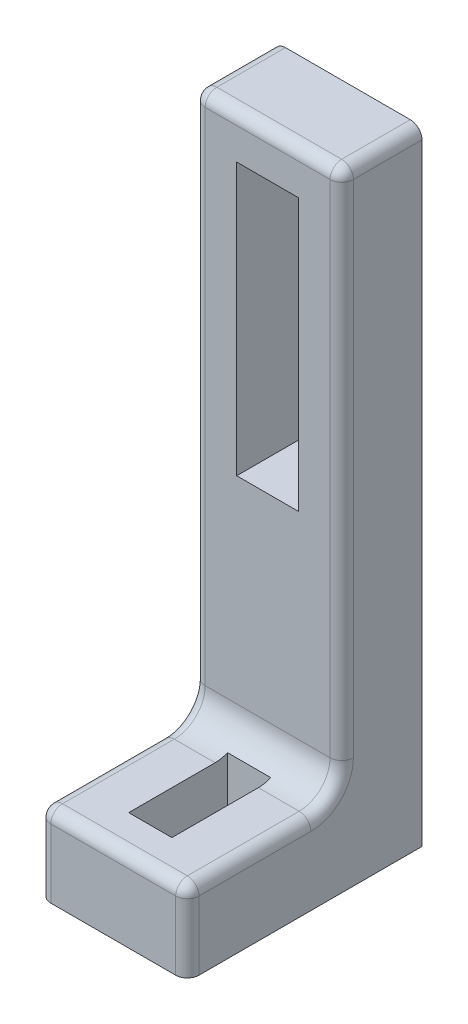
ISO-10303-21;
HEADER;
FILE_DESCRIPTION(('STEP AP214'),'2;1');
FILE_NAME('part.step','',(''),(''),'','','');
FILE_SCHEMA(('AUTOMOTIVE_DESIGN { 1 0 10303 214 1 1 1 1 }'));
ENDSEC;
DATA;
#1=APPLICATION_CONTEXT('core data for automotive mechanical design processes');
#2=APPLICATION_PROTOCOL_DEFINITION('international standard','automotive_design',2000,#1);
#3=PRODUCT_CONTEXT('',#1,'mechanical');
#4=PRODUCT('Part','Part','',(#3));
#5=PRODUCT_RELATED_PRODUCT_CATEGORY('part','',(#4));
#6=PRODUCT_DEFINITION_FORMATION('','',#4);
#7=PRODUCT_DEFINITION_CONTEXT('part definition',#1,'design');
#8=PRODUCT_DEFINITION('design','',#6,#7);
#9=PRODUCT_DEFINITION_SHAPE('','',#8);
#10=(LENGTH_UNIT() NAMED_UNIT(*) SI_UNIT(.MILLI.,.METRE.));
#11=(NAMED_UNIT(*) PLANE_ANGLE_UNIT() SI_UNIT($,.RADIAN.));
#12=(NAMED_UNIT(*) SI_UNIT($,.STERADIAN.) SOLID_ANGLE_UNIT());
#13=UNCERTAINTY_MEASURE_WITH_UNIT(LENGTH_MEASURE(1.E-05),#10,'distance_accuracy_value','');
#14=(GEOMETRIC_REPRESENTATION_CONTEXT(3) GLOBAL_UNCERTAINTY_ASSIGNED_CONTEXT((#13)) GLOBAL_UNIT_ASSIGNED_CONTEXT((#10,
#11,#12)) REPRESENTATION_CONTEXT('',''));
#15=CARTESIAN_POINT('',(0.,0.,0.));
#16=DIRECTION('',(0.,0.,1.));
#17=DIRECTION('',(1.,0.,0.));
#18=AXIS2_PLACEMENT_3D('',#15,#16,#17);
#19=CARTESIAN_POINT('',(19.05,125.3375,43.1375));
#20=DIRECTION('',(0.,-1.,0.));
#21=DIRECTION('',(0.,0.,-1.));
#22=AXIS2_PLACEMENT_3D('',#19,#20,#21);
#23=PLANE('',#22);
#24=DIRECTION('',(0.,0.,1.));
#25=VECTOR('',#24,1.);
#26=CARTESIAN_POINT('',(-16.05,125.3375,43.1375));
#27=LINE('',#26,#25);
#28=CARTESIAN_POINT('',(-16.05,125.3375,22.5));
#29=VERTEX_POINT('',#28);
#30=CARTESIAN_POINT('',(-16.05,125.3375,40.1375));
#31=VERTEX_POINT('',#30);
#32=EDGE_CURVE('E309',#29,#31,#27,.T.);
#33=ORIENTED_EDGE('',*,*,#32,.T.);
#34=DIRECTION('',(-1.,0.,0.));
#35=VECTOR('',#34,1.);
#36=CARTESIAN_POINT('',(19.05,125.3375,40.1375));
#37=LINE('',#36,#35);
#38=CARTESIAN_POINT('',(16.05,125.3375,40.1375));
#39=VERTEX_POINT('',#38);
#40=EDGE_CURVE('E11',#31,#39,#37,.F.);
#41=ORIENTED_EDGE('',*,*,#40,.T.);
#42=DIRECTION('',(0.,0.,1.));
#43=VECTOR('',#42,1.);
#44=CARTESIAN_POINT('',(16.05,125.3375,43.1375));
#45=LINE('',#44,#43);
#46=CARTESIAN_POINT('',(16.05,125.3375,22.5));
#47=VERTEX_POINT('',#46);
#48=EDGE_CURVE('E307',#39,#47,#45,.F.);
#49=ORIENTED_EDGE('',*,*,#48,.T.);
#50=DIRECTION('',(-1.,0.,0.));
#51=VECTOR('',#50,1.);
#52=CARTESIAN_POINT('',(19.05,125.3375,22.5));
#53=LINE('',#52,#51);
#54=EDGE_CURVE('E279',#47,#29,#53,.T.);
#55=ORIENTED_EDGE('',*,*,#54,.T.);
#56=EDGE_LOOP('',(#33,#41,#49,#55));
#57=FACE_BOUND('',#56,.T.);
#58=ADVANCED_FACE('F36',(#57),#23,.F.);
#59=CARTESIAN_POINT('',(19.05,-14.3625,43.1375));
#60=DIRECTION('',(0.,0.,-1.));
#61=DIRECTION('',(0.,1.,0.));
#62=AXIS2_PLACEMENT_3D('',#59,#60,#61);
#63=PLANE('',#62);
#64=DIRECTION('',(-1.,0.,0.));
#65=VECTOR('',#64,1.);
#66=CARTESIAN_POINT('',(19.05,-6.42500000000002,43.1375));
#67=LINE('',#66,#65);
#68=CARTESIAN_POINT('',(-16.05,-6.42500000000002,43.1375));
#69=VERTEX_POINT('',#68);
#70=CARTESIAN_POINT('',(16.05,-6.42500000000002,43.1375));
#71=VERTEX_POINT('',#70);
#72=EDGE_CURVE('E296',#69,#71,#67,.F.);
#73=ORIENTED_EDGE('',*,*,#72,.T.);
#74=DIRECTION('',(0.,-1.,0.));
#75=VECTOR('',#74,1.);
#76=CARTESIAN_POINT('',(16.05,-14.3625,43.1375));
#77=LINE('',#76,#75);
#78=CARTESIAN_POINT('',(16.05,122.3375,43.1375));
#79=VERTEX_POINT('',#78);
#80=EDGE_CURVE('E346',#71,#79,#77,.F.);
#81=ORIENTED_EDGE('',*,*,#80,.T.);
#82=DIRECTION('',(-1.,0.,0.));
#83=VECTOR('',#82,1.);
#84=CARTESIAN_POINT('',(19.05,122.3375,43.1375));
#85=LINE('',#84,#83);
#86=CARTESIAN_POINT('',(-16.05,122.3375,43.1375));
#87=VERTEX_POINT('',#86);
#88=EDGE_CURVE('E342',#79,#87,#85,.T.);
#89=ORIENTED_EDGE('',*,*,#88,.T.);
#90=DIRECTION('',(0.,-1.,0.));
#91=VECTOR('',#90,1.);
#92=CARTESIAN_POINT('',(-16.05,-6.42500000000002,43.1375));
#93=LINE('',#92,#91);
#94=EDGE_CURVE('E344',#87,#69,#93,.T.);
#95=ORIENTED_EDGE('',*,*,#94,.T.);
#96=EDGE_LOOP('',(#73,#81,#89,#95));
#97=FACE_BOUND('',#96,.T.);
#98=DIRECTION('',(1.,0.,0.));
#99=VECTOR('',#98,1.);
#100=CARTESIAN_POINT('',(-7.93749999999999,44.375,43.1375));
#101=LINE('',#100,#99);
#102=CARTESIAN_POINT('',(-7.93749999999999,44.375,43.1375));
#103=VERTEX_POINT('',#102);
#104=CARTESIAN_POINT('',(7.93749999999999,44.375,43.1375));
#105=VERTEX_POINT('',#104);
#106=EDGE_CURVE('E256',#103,#105,#101,.T.);
#107=ORIENTED_EDGE('',*,*,#106,.F.);
#108=DIRECTION('',(0.,-1.,0.));
#109=VECTOR('',#108,1.);
#110=CARTESIAN_POINT('',(-7.9375,114.225,43.1375));
#111=LINE('',#110,#109);
#112=CARTESIAN_POINT('',(-7.9375,114.225,43.1375));
#113=VERTEX_POINT('',#112);
#114=EDGE_CURVE('E237',#113,#103,#111,.T.);
#115=ORIENTED_EDGE('',*,*,#114,.F.);
#116=DIRECTION('',(-1.,0.,0.));
#117=VECTOR('',#116,1.);
#118=CARTESIAN_POINT('',(-7.9375,114.225,43.1375));
#119=LINE('',#118,#117);
#120=CARTESIAN_POINT('',(7.9375,114.225,43.1375));
#121=VERTEX_POINT('',#120);
#122=EDGE_CURVE('E245',#121,#113,#119,.T.);
#123=ORIENTED_EDGE('',*,*,#122,.F.);
#124=DIRECTION('',(0.,1.,0.));
#125=VECTOR('',#124,1.);
#126=CARTESIAN_POINT('',(7.9375,114.225,43.1375));
#127=LINE('',#126,#125);
#128=EDGE_CURVE('E259',#105,#121,#127,.T.);
#129=ORIENTED_EDGE('',*,*,#128,.F.);
#130=EDGE_LOOP('',(#107,#115,#123,#129));
#131=FACE_BOUND('',#130,.T.);
#132=ADVANCED_FACE('F448',(#97,#131),#63,.F.);
#133=CARTESIAN_POINT('',(19.05,-14.3625,82.825));
#134=DIRECTION('',(0.,-1.,0.));
#135=DIRECTION('',(0.,0.,-1.));
#136=AXIS2_PLACEMENT_3D('',#133,#134,#135);
#137=PLANE('',#136);
#138=DIRECTION('',(-1.,0.,0.));
#139=VECTOR('',#138,1.);
#140=CARTESIAN_POINT('',(19.05,-14.3625,79.825));
#141=LINE('',#140,#139);
#142=CARTESIAN_POINT('',(-16.05,-14.3625,79.825));
#143=VERTEX_POINT('',#142);
#144=CARTESIAN_POINT('',(16.05,-14.3625,79.825));
#145=VERTEX_POINT('',#144);
#146=EDGE_CURVE('E355',#143,#145,#141,.F.);
#147=ORIENTED_EDGE('',*,*,#146,.T.);
#148=DIRECTION('',(0.,0.,1.));
#149=VECTOR('',#148,1.);
#150=CARTESIAN_POINT('',(16.05,-14.3625,82.825));
#151=LINE('',#150,#149);
#152=CARTESIAN_POINT('',(16.05,-14.3625,51.075));
#153=VERTEX_POINT('',#152);
#154=EDGE_CURVE('E357',#145,#153,#151,.F.);
#155=ORIENTED_EDGE('',*,*,#154,.T.);
#156=DIRECTION('',(-1.,0.,0.));
#157=VECTOR('',#156,1.);
#158=CARTESIAN_POINT('',(-19.05,-14.3625,51.075));
#159=LINE('',#158,#157);
#160=CARTESIAN_POINT('',(5.55625,-14.3625,51.075));
#161=VERTEX_POINT('',#160);
#162=EDGE_CURVE('E294',#153,#161,#159,.T.);
#163=ORIENTED_EDGE('',*,*,#162,.T.);
#164=DIRECTION('',(0.,0.,-1.));
#165=VECTOR('',#164,1.);
#166=CARTESIAN_POINT('',(5.55625,-14.3625,73.3));
#167=LINE('',#166,#165);
#168=CARTESIAN_POINT('',(5.55625,-14.3625,73.3));
#169=VERTEX_POINT('',#168);
#170=EDGE_CURVE('E225',#169,#161,#167,.T.);
#171=ORIENTED_EDGE('',*,*,#170,.F.);
#172=DIRECTION('',(1.,0.,0.));
#173=VECTOR('',#172,1.);
#174=CARTESIAN_POINT('',(-5.55625,-14.3625,73.3));
#175=LINE('',#174,#173);
#176=CARTESIAN_POINT('',(-5.55625,-14.3625,73.3));
#177=VERTEX_POINT('',#176);
#178=EDGE_CURVE('E228',#177,#169,#175,.T.);
#179=ORIENTED_EDGE('',*,*,#178,.F.);
#180=DIRECTION('',(0.,0.,1.));
#181=VECTOR('',#180,1.);
#182=CARTESIAN_POINT('',(-5.55625,-14.3625,73.3));
#183=LINE('',#182,#181);
#184=CARTESIAN_POINT('',(-5.55625,-14.3625,51.075));
#185=VERTEX_POINT('',#184);
#186=EDGE_CURVE('E207',#185,#177,#183,.T.);
#187=ORIENTED_EDGE('',*,*,#186,.F.);
#188=DIRECTION('',(-1.,0.,0.));
#189=VECTOR('',#188,1.);
#190=CARTESIAN_POINT('',(-19.05,-14.3625,51.075));
#191=LINE('',#190,#189);
#192=CARTESIAN_POINT('',(-16.05,-14.3625,51.075));
#193=VERTEX_POINT('',#192);
#194=EDGE_CURVE('E291',#185,#193,#191,.T.);
#195=ORIENTED_EDGE('',*,*,#194,.T.);
#196=DIRECTION('',(0.,0.,1.));
#197=VECTOR('',#196,1.);
#198=CARTESIAN_POINT('',(-16.05,-14.3625,79.825));
#199=LINE('',#198,#197);
#200=EDGE_CURVE('E353',#193,#143,#199,.T.);
#201=ORIENTED_EDGE('',*,*,#200,.T.);
#202=EDGE_LOOP('',(#147,#155,#163,#171,#179,#187,#195,#201));
#203=FACE_BOUND('',#202,.T.);
#204=ADVANCED_FACE('F489',(#203),#137,.F.);
#205=CARTESIAN_POINT('',(19.05,-35.,82.825));
#206=DIRECTION('',(0.,0.,-1.));
#207=DIRECTION('',(-1.,0.,0.));
#208=AXIS2_PLACEMENT_3D('',#205,#206,#207);
#209=PLANE('',#208);
#210=DIRECTION('',(0.,-1.,0.));
#211=VECTOR('',#210,1.);
#212=CARTESIAN_POINT('',(16.05,-35.,82.825));
#213=LINE('',#212,#211);
#214=CARTESIAN_POINT('',(16.05,-35.,82.825));
#215=VERTEX_POINT('',#214);
#216=CARTESIAN_POINT('',(16.05,-17.3625,82.825));
#217=VERTEX_POINT('',#216);
#218=EDGE_CURVE('E324',#215,#217,#213,.F.);
#219=ORIENTED_EDGE('',*,*,#218,.T.);
#220=DIRECTION('',(-1.,0.,0.));
#221=VECTOR('',#220,1.);
#222=CARTESIAN_POINT('',(19.05,-17.3625,82.825));
#223=LINE('',#222,#221);
#224=CARTESIAN_POINT('',(-16.05,-17.3625,82.825));
#225=VERTEX_POINT('',#224);
#226=EDGE_CURVE('E361',#217,#225,#223,.T.);
#227=ORIENTED_EDGE('',*,*,#226,.T.);
#228=DIRECTION('',(0.,-1.,0.));
#229=VECTOR('',#228,1.);
#230=CARTESIAN_POINT('',(-16.05,-35.,82.825));
#231=LINE('',#230,#229);
#232=CARTESIAN_POINT('',(-16.05,-35.,82.825));
#233=VERTEX_POINT('',#232);
#234=EDGE_CURVE('E327',#225,#233,#231,.T.);
#235=ORIENTED_EDGE('',*,*,#234,.T.);
#236=DIRECTION('',(-1.,0.,0.));
#237=VECTOR('',#236,1.);
#238=CARTESIAN_POINT('',(19.05,-35.,82.825));
#239=LINE('',#238,#237);
#240=EDGE_CURVE('E288',#215,#233,#239,.T.);
#241=ORIENTED_EDGE('',*,*,#240,.F.);
#242=EDGE_LOOP('',(#219,#227,#235,#241));
#243=FACE_BOUND('',#242,.T.);
#244=ADVANCED_FACE('F734',(#243),#209,.F.);
#245=CARTESIAN_POINT('',(19.05,-35.,22.5));
#246=DIRECTION('',(0.,1.,0.));
#247=DIRECTION('',(0.,0.,1.));
#248=AXIS2_PLACEMENT_3D('',#245,#246,#247);
#249=PLANE('',#248);
#250=DIRECTION('',(-1.,0.,0.));
#251=VECTOR('',#250,1.);
#252=CARTESIAN_POINT('',(-5.55625,-35.,47.9));
#253=LINE('',#252,#251);
#254=CARTESIAN_POINT('',(5.55625,-35.,47.9));
#255=VERTEX_POINT('',#254);
#256=CARTESIAN_POINT('',(-5.55625,-35.,47.9));
#257=VERTEX_POINT('',#256);
#258=EDGE_CURVE('E212',#255,#257,#253,.T.);
#259=ORIENTED_EDGE('',*,*,#258,.T.);
#260=DIRECTION('',(0.,0.,1.));
#261=VECTOR('',#260,1.);
#262=CARTESIAN_POINT('',(-5.55625,-35.,73.3));
#263=LINE('',#262,#261);
#264=CARTESIAN_POINT('',(-5.55625,-35.,73.3));
#265=VERTEX_POINT('',#264);
#266=EDGE_CURVE('E204',#257,#265,#263,.T.);
#267=ORIENTED_EDGE('',*,*,#266,.T.);
#268=DIRECTION('',(1.,0.,0.));
#269=VECTOR('',#268,1.);
#270=CARTESIAN_POINT('',(-5.55625,-35.,73.3));
#271=LINE('',#270,#269);
#272=CARTESIAN_POINT('',(5.55625,-35.,73.3));
#273=VERTEX_POINT('',#272);
#274=EDGE_CURVE('E216',#265,#273,#271,.T.);
#275=ORIENTED_EDGE('',*,*,#274,.T.);
#276=DIRECTION('',(0.,0.,-1.));
#277=VECTOR('',#276,1.);
#278=CARTESIAN_POINT('',(5.55625,-35.,73.3));
#279=LINE('',#278,#277);
#280=EDGE_CURVE('E220',#273,#255,#279,.T.);
#281=ORIENTED_EDGE('',*,*,#280,.T.);
#282=EDGE_LOOP('',(#259,#267,#275,#281));
#283=FACE_BOUND('',#282,.T.);
#284=ORIENTED_EDGE('',*,*,#240,.T.);
#285=CARTESIAN_POINT('',(-16.05,-35.,79.825));
#286=DIRECTION('',(0.,1.,0.));
#287=DIRECTION('',(0.,0.,1.));
#288=AXIS2_PLACEMENT_3D('',#285,#286,#287);
#289=CIRCLE('',#288,3.);
#290=CARTESIAN_POINT('',(-19.05,-35.,79.825));
#291=VERTEX_POINT('',#290);
#292=EDGE_CURVE('E331',#233,#291,#289,.F.);
#293=ORIENTED_EDGE('',*,*,#292,.T.);
#294=DIRECTION('',(0.,0.,-1.));
#295=VECTOR('',#294,1.);
#296=CARTESIAN_POINT('',(-19.05,-35.,22.5));
#297=LINE('',#296,#295);
#298=CARTESIAN_POINT('',(-19.05,-35.,22.5));
#299=VERTEX_POINT('',#298);
#300=EDGE_CURVE('E266',#291,#299,#297,.T.);
#301=ORIENTED_EDGE('',*,*,#300,.T.);
#302=DIRECTION('',(-1.,0.,0.));
#303=VECTOR('',#302,1.);
#304=CARTESIAN_POINT('',(19.05,-35.,22.5));
#305=LINE('',#304,#303);
#306=CARTESIAN_POINT('',(19.05,-35.,22.5));
#307=VERTEX_POINT('',#306);
#308=EDGE_CURVE('E285',#307,#299,#305,.T.);
#309=ORIENTED_EDGE('',*,*,#308,.F.);
#310=DIRECTION('',(0.,0.,-1.));
#311=VECTOR('',#310,1.);
#312=CARTESIAN_POINT('',(19.05,-35.,22.5));
#313=LINE('',#312,#311);
#314=CARTESIAN_POINT('',(19.05,-35.,79.825));
#315=VERTEX_POINT('',#314);
#316=EDGE_CURVE('E273',#315,#307,#313,.T.);
#317=ORIENTED_EDGE('',*,*,#316,.F.);
#318=CARTESIAN_POINT('',(16.05,-35.,79.825));
#319=DIRECTION('',(0.,1.,0.));
#320=DIRECTION('',(0.,0.,1.));
#321=AXIS2_PLACEMENT_3D('',#318,#319,#320);
#322=CIRCLE('',#321,3.);
#323=EDGE_CURVE('E329',#315,#215,#322,.F.);
#324=ORIENTED_EDGE('',*,*,#323,.T.);
#325=EDGE_LOOP('',(#284,#293,#301,#309,#317,#324));
#326=FACE_BOUND('',#325,.T.);
#327=ADVANCED_FACE('F222',(#283,#326),#249,.F.);
#328=CARTESIAN_POINT('',(19.05,125.3375,22.5));
#329=DIRECTION('',(0.,0.,1.));
#330=DIRECTION('',(0.,-1.,0.));
#331=AXIS2_PLACEMENT_3D('',#328,#329,#330);
#332=PLANE('',#331);
#333=DIRECTION('',(0.,1.,0.));
#334=VECTOR('',#333,1.);
#335=CARTESIAN_POINT('',(-19.05,125.3375,22.5));
#336=LINE('',#335,#334);
#337=CARTESIAN_POINT('',(-19.05,122.3375,22.5));
#338=VERTEX_POINT('',#337);
#339=EDGE_CURVE('E276',#299,#338,#336,.T.);
#340=ORIENTED_EDGE('',*,*,#339,.T.);
#341=CARTESIAN_POINT('',(-16.05,122.3375,22.5));
#342=DIRECTION('',(0.,0.,1.));
#343=DIRECTION('',(0.,-1.,0.));
#344=AXIS2_PLACEMENT_3D('',#341,#342,#343);
#345=CIRCLE('',#344,3.);
#346=EDGE_CURVE('E317',#338,#29,#345,.F.);
#347=ORIENTED_EDGE('',*,*,#346,.T.);
#348=ORIENTED_EDGE('',*,*,#54,.F.);
#349=CARTESIAN_POINT('',(16.05,122.3375,22.5));
#350=DIRECTION('',(0.,0.,1.));
#351=DIRECTION('',(0.,-1.,0.));
#352=AXIS2_PLACEMENT_3D('',#349,#350,#351);
#353=CIRCLE('',#352,3.);
#354=CARTESIAN_POINT('',(19.05,122.3375,22.5));
#355=VERTEX_POINT('',#354);
#356=EDGE_CURVE('E315',#47,#355,#353,.F.);
#357=ORIENTED_EDGE('',*,*,#356,.T.);
#358=DIRECTION('',(0.,1.,0.));
#359=VECTOR('',#358,1.);
#360=CARTESIAN_POINT('',(19.05,125.3375,22.5));
#361=LINE('',#360,#359);
#362=EDGE_CURVE('E275',#307,#355,#361,.T.);
#363=ORIENTED_EDGE('',*,*,#362,.F.);
#364=ORIENTED_EDGE('',*,*,#308,.T.);
#365=EDGE_LOOP('',(#340,#347,#348,#357,#363,#364));
#366=FACE_BOUND('',#365,.T.);
#367=ADVANCED_FACE('F424',(#366),#332,.F.);
#368=CARTESIAN_POINT('',(19.05,0.,0.));
#369=DIRECTION('',(-1.,0.,0.));
#370=DIRECTION('',(0.,0.,1.));
#371=AXIS2_PLACEMENT_3D('',#368,#369,#370);
#372=PLANE('',#371);
#373=DIRECTION('',(0.,0.,1.));
#374=VECTOR('',#373,1.);
#375=CARTESIAN_POINT('',(19.05,122.3375,0.));
#376=LINE('',#375,#374);
#377=CARTESIAN_POINT('',(19.05,122.3375,40.1375));
#378=VERTEX_POINT('',#377);
#379=EDGE_CURVE('E321',#355,#378,#376,.T.);
#380=ORIENTED_EDGE('',*,*,#379,.T.);
#381=DIRECTION('',(0.,-1.,0.));
#382=VECTOR('',#381,1.);
#383=CARTESIAN_POINT('',(19.05,0.,40.1375));
#384=LINE('',#383,#382);
#385=CARTESIAN_POINT('',(19.05,-6.42500000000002,40.1375));
#386=VERTEX_POINT('',#385);
#387=EDGE_CURVE('E340',#378,#386,#384,.T.);
#388=ORIENTED_EDGE('',*,*,#387,.T.);
#389=CARTESIAN_POINT('',(19.05,-6.42500000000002,51.075));
#390=DIRECTION('',(-1.,0.,0.));
#391=DIRECTION('',(0.,0.,1.));
#392=AXIS2_PLACEMENT_3D('',#389,#390,#391);
#393=CIRCLE('',#392,10.9375);
#394=CARTESIAN_POINT('',(19.05,-17.3625,51.075));
#395=VERTEX_POINT('',#394);
#396=EDGE_CURVE('E338',#386,#395,#393,.T.);
#397=ORIENTED_EDGE('',*,*,#396,.T.);
#398=DIRECTION('',(0.,0.,1.));
#399=VECTOR('',#398,1.);
#400=CARTESIAN_POINT('',(19.05,-17.3625,0.));
#401=LINE('',#400,#399);
#402=CARTESIAN_POINT('',(19.05,-17.3625,79.825));
#403=VERTEX_POINT('',#402);
#404=EDGE_CURVE('E336',#395,#403,#401,.T.);
#405=ORIENTED_EDGE('',*,*,#404,.T.);
#406=DIRECTION('',(0.,-1.,0.));
#407=VECTOR('',#406,1.);
#408=CARTESIAN_POINT('',(19.05,0.,79.825));
#409=LINE('',#408,#407);
#410=EDGE_CURVE('E319',#403,#315,#409,.T.);
#411=ORIENTED_EDGE('',*,*,#410,.T.);
#412=ORIENTED_EDGE('',*,*,#316,.T.);
#413=ORIENTED_EDGE('',*,*,#362,.T.);
#414=EDGE_LOOP('',(#380,#388,#397,#405,#411,#412,#413));
#415=FACE_BOUND('',#414,.T.);
#416=ADVANCED_FACE('F430',(#415),#372,.F.);
#417=CARTESIAN_POINT('',(-19.05,0.,0.));
#418=DIRECTION('',(-1.,0.,0.));
#419=DIRECTION('',(0.,0.,1.));
#420=AXIS2_PLACEMENT_3D('',#417,#418,#419);
#421=PLANE('',#420);
#422=DIRECTION('',(0.,-1.,0.));
#423=VECTOR('',#422,1.);
#424=CARTESIAN_POINT('',(-19.05,-14.3625,79.825));
#425=LINE('',#424,#423);
#426=CARTESIAN_POINT('',(-19.05,-17.3625,79.825));
#427=VERTEX_POINT('',#426);
#428=EDGE_CURVE('E311',#291,#427,#425,.F.);
#429=ORIENTED_EDGE('',*,*,#428,.T.);
#430=DIRECTION('',(0.,0.,1.));
#431=VECTOR('',#430,1.);
#432=CARTESIAN_POINT('',(-19.05,-17.3625,51.075));
#433=LINE('',#432,#431);
#434=CARTESIAN_POINT('',(-19.05,-17.3625,51.075));
#435=VERTEX_POINT('',#434);
#436=EDGE_CURVE('E60',#427,#435,#433,.F.);
#437=ORIENTED_EDGE('',*,*,#436,.T.);
#438=CARTESIAN_POINT('',(-19.05,-6.42500000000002,51.075));
#439=DIRECTION('',(-1.,0.,0.));
#440=DIRECTION('',(0.,0.,1.));
#441=AXIS2_PLACEMENT_3D('',#438,#439,#440);
#442=CIRCLE('',#441,10.9375);
#443=CARTESIAN_POINT('',(-19.05,-6.42500000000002,40.1375));
#444=VERTEX_POINT('',#443);
#445=EDGE_CURVE('E367',#435,#444,#442,.F.);
#446=ORIENTED_EDGE('',*,*,#445,.T.);
#447=DIRECTION('',(0.,-1.,0.));
#448=VECTOR('',#447,1.);
#449=CARTESIAN_POINT('',(-19.05,122.3375,40.1375));
#450=LINE('',#449,#448);
#451=CARTESIAN_POINT('',(-19.05,122.3375,40.1375));
#452=VERTEX_POINT('',#451);
#453=EDGE_CURVE('E365',#444,#452,#450,.F.);
#454=ORIENTED_EDGE('',*,*,#453,.T.);
#455=DIRECTION('',(0.,0.,1.));
#456=VECTOR('',#455,1.);
#457=CARTESIAN_POINT('',(-19.05,122.3375,22.5));
#458=LINE('',#457,#456);
#459=EDGE_CURVE('E313',#452,#338,#458,.F.);
#460=ORIENTED_EDGE('',*,*,#459,.T.);
#461=ORIENTED_EDGE('',*,*,#339,.F.);
#462=ORIENTED_EDGE('',*,*,#300,.F.);
#463=EDGE_LOOP('',(#429,#437,#446,#454,#460,#461,#462));
#464=FACE_BOUND('',#463,.T.);
#465=ADVANCED_FACE('F418',(#464),#421,.T.);
#466=CARTESIAN_POINT('',(-7.9375,114.225,27.2625));
#467=DIRECTION('',(-1.,0.,0.));
#468=DIRECTION('',(0.,-1.,0.));
#469=AXIS2_PLACEMENT_3D('',#466,#467,#468);
#470=PLANE('',#469);
#471=ORIENTED_EDGE('',*,*,#114,.T.);
#472=DIRECTION('',(0.,0.,1.));
#473=VECTOR('',#472,1.);
#474=CARTESIAN_POINT('',(-7.93749999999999,44.375,27.2625));
#475=LINE('',#474,#473);
#476=CARTESIAN_POINT('',(-7.93749999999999,44.375,27.2625));
#477=VERTEX_POINT('',#476);
#478=EDGE_CURVE('E254',#477,#103,#475,.T.);
#479=ORIENTED_EDGE('',*,*,#478,.F.);
#480=DIRECTION('',(0.,-1.,0.));
#481=VECTOR('',#480,1.);
#482=CARTESIAN_POINT('',(-7.9375,114.225,27.2625));
#483=LINE('',#482,#481);
#484=CARTESIAN_POINT('',(-7.9375,114.225,27.2625));
#485=VERTEX_POINT('',#484);
#486=EDGE_CURVE('E241',#485,#477,#483,.T.);
#487=ORIENTED_EDGE('',*,*,#486,.F.);
#488=DIRECTION('',(0.,0.,1.));
#489=VECTOR('',#488,1.);
#490=CARTESIAN_POINT('',(-7.9375,114.225,27.2625));
#491=LINE('',#490,#489);
#492=EDGE_CURVE('E264',#485,#113,#491,.T.);
#493=ORIENTED_EDGE('',*,*,#492,.T.);
#494=EDGE_LOOP('',(#471,#479,#487,#493));
#495=FACE_BOUND('',#494,.T.);
#496=ADVANCED_FACE('F697',(#495),#470,.F.);
#497=CARTESIAN_POINT('',(-7.9375,114.225,27.2625));
#498=DIRECTION('',(0.,1.,0.));
#499=DIRECTION('',(0.,0.,1.));
#500=AXIS2_PLACEMENT_3D('',#497,#498,#499);
#501=PLANE('',#500);
#502=ORIENTED_EDGE('',*,*,#122,.T.);
#503=ORIENTED_EDGE('',*,*,#492,.F.);
#504=DIRECTION('',(-1.,0.,0.));
#505=VECTOR('',#504,1.);
#506=CARTESIAN_POINT('',(-7.9375,114.225,27.2625));
#507=LINE('',#506,#505);
#508=CARTESIAN_POINT('',(7.9375,114.225,27.2625));
#509=VERTEX_POINT('',#508);
#510=EDGE_CURVE('E251',#509,#485,#507,.T.);
#511=ORIENTED_EDGE('',*,*,#510,.F.);
#512=DIRECTION('',(0.,0.,1.));
#513=VECTOR('',#512,1.);
#514=CARTESIAN_POINT('',(7.9375,114.225,27.2625));
#515=LINE('',#514,#513);
#516=EDGE_CURVE('E267',#509,#121,#515,.T.);
#517=ORIENTED_EDGE('',*,*,#516,.T.);
#518=EDGE_LOOP('',(#502,#503,#511,#517));
#519=FACE_BOUND('',#518,.T.);
#520=ADVANCED_FACE('F688',(#519),#501,.F.);
#521=CARTESIAN_POINT('',(7.9375,114.225,27.2625));
#522=DIRECTION('',(1.,0.,0.));
#523=DIRECTION('',(0.,1.,0.));
#524=AXIS2_PLACEMENT_3D('',#521,#522,#523);
#525=PLANE('',#524);
#526=ORIENTED_EDGE('',*,*,#128,.T.);
#527=ORIENTED_EDGE('',*,*,#516,.F.);
#528=DIRECTION('',(0.,1.,0.));
#529=VECTOR('',#528,1.);
#530=CARTESIAN_POINT('',(7.9375,114.225,27.2625));
#531=LINE('',#530,#529);
#532=CARTESIAN_POINT('',(7.93749999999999,44.375,27.2625));
#533=VERTEX_POINT('',#532);
#534=EDGE_CURVE('E248',#533,#509,#531,.T.);
#535=ORIENTED_EDGE('',*,*,#534,.F.);
#536=DIRECTION('',(0.,0.,1.));
#537=VECTOR('',#536,1.);
#538=CARTESIAN_POINT('',(7.93749999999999,44.375,27.2625));
#539=LINE('',#538,#537);
#540=EDGE_CURVE('E269',#533,#105,#539,.T.);
#541=ORIENTED_EDGE('',*,*,#540,.T.);
#542=EDGE_LOOP('',(#526,#527,#535,#541));
#543=FACE_BOUND('',#542,.T.);
#544=ADVANCED_FACE('F679',(#543),#525,.F.);
#545=CARTESIAN_POINT('',(-7.93749999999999,44.375,27.2625));
#546=DIRECTION('',(0.,-1.,0.));
#547=DIRECTION('',(0.,0.,-1.));
#548=AXIS2_PLACEMENT_3D('',#545,#546,#547);
#549=PLANE('',#548);
#550=ORIENTED_EDGE('',*,*,#106,.T.);
#551=ORIENTED_EDGE('',*,*,#540,.F.);
#552=DIRECTION('',(1.,0.,0.));
#553=VECTOR('',#552,1.);
#554=CARTESIAN_POINT('',(-7.93749999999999,44.375,27.2625));
#555=LINE('',#554,#553);
#556=EDGE_CURVE('E244',#477,#533,#555,.T.);
#557=ORIENTED_EDGE('',*,*,#556,.F.);
#558=ORIENTED_EDGE('',*,*,#478,.T.);
#559=EDGE_LOOP('',(#550,#551,#557,#558));
#560=FACE_BOUND('',#559,.T.);
#561=ADVANCED_FACE('F670',(#560),#549,.F.);
#562=CARTESIAN_POINT('',(0.,0.,27.2625));
#563=DIRECTION('',(0.,0.,1.));
#564=DIRECTION('',(1.,0.,0.));
#565=AXIS2_PLACEMENT_3D('',#562,#563,#564);
#566=PLANE('',#565);
#567=ORIENTED_EDGE('',*,*,#486,.T.);
#568=ORIENTED_EDGE('',*,*,#556,.T.);
#569=ORIENTED_EDGE('',*,*,#534,.T.);
#570=ORIENTED_EDGE('',*,*,#510,.T.);
#571=EDGE_LOOP('',(#567,#568,#569,#570));
#572=FACE_BOUND('',#571,.T.);
#573=ADVANCED_FACE('F663',(#572),#566,.T.);
#574=CARTESIAN_POINT('',(-5.55625,-35.,73.3));
#575=DIRECTION('',(-1.,0.,0.));
#576=DIRECTION('',(0.,0.,1.));
#577=AXIS2_PLACEMENT_3D('',#574,#575,#576);
#578=PLANE('',#577);
#579=DIRECTION('',(0.,1.,0.));
#580=VECTOR('',#579,1.);
#581=CARTESIAN_POINT('',(-5.55625,-35.,47.9));
#582=LINE('',#581,#580);
#583=CARTESIAN_POINT('',(-5.55625,-13.6998389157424,47.9));
#584=VERTEX_POINT('',#583);
#585=EDGE_CURVE('E235',#257,#584,#582,.T.);
#586=ORIENTED_EDGE('',*,*,#585,.T.);
#587=CARTESIAN_POINT('',(-5.55625,-6.42500000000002,51.075));
#588=DIRECTION('',(-1.,0.,0.));
#589=DIRECTION('',(0.,0.,1.));
#590=AXIS2_PLACEMENT_3D('',#587,#588,#589);
#591=CIRCLE('',#590,7.9375);
#592=EDGE_CURVE('E305',#584,#185,#591,.T.);
#593=ORIENTED_EDGE('',*,*,#592,.T.);
#594=ORIENTED_EDGE('',*,*,#186,.T.);
#595=DIRECTION('',(0.,1.,0.));
#596=VECTOR('',#595,1.);
#597=CARTESIAN_POINT('',(-5.55625,-35.,73.3));
#598=LINE('',#597,#596);
#599=EDGE_CURVE('E200',#265,#177,#598,.T.);
#600=ORIENTED_EDGE('',*,*,#599,.F.);
#601=ORIENTED_EDGE('',*,*,#266,.F.);
#602=EDGE_LOOP('',(#586,#593,#594,#600,#601));
#603=FACE_BOUND('',#602,.T.);
#604=ADVANCED_FACE('F202',(#603),#578,.F.);
#605=CARTESIAN_POINT('',(-5.55625,-35.,47.9));
#606=DIRECTION('',(0.,0.,-1.));
#607=DIRECTION('',(-1.,0.,0.));
#608=AXIS2_PLACEMENT_3D('',#605,#606,#607);
#609=PLANE('',#608);
#610=DIRECTION('',(0.,1.,0.));
#611=VECTOR('',#610,1.);
#612=CARTESIAN_POINT('',(5.55625,-35.,47.9));
#613=LINE('',#612,#611);
#614=CARTESIAN_POINT('',(5.55625,-13.6998389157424,47.9));
#615=VERTEX_POINT('',#614);
#616=EDGE_CURVE('E238',#255,#615,#613,.T.);
#617=ORIENTED_EDGE('',*,*,#616,.T.);
#618=DIRECTION('',(1.,0.,0.));
#619=VECTOR('',#618,1.);
#620=CARTESIAN_POINT('',(5.55625,-13.6998389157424,47.9));
#621=LINE('',#620,#619);
#622=EDGE_CURVE('E302',#615,#584,#621,.F.);
#623=ORIENTED_EDGE('',*,*,#622,.T.);
#624=ORIENTED_EDGE('',*,*,#585,.F.);
#625=ORIENTED_EDGE('',*,*,#258,.F.);
#626=EDGE_LOOP('',(#617,#623,#624,#625));
#627=FACE_BOUND('',#626,.T.);
#628=ADVANCED_FACE('F646',(#627),#609,.F.);
#629=CARTESIAN_POINT('',(5.55625,-35.,73.3));
#630=DIRECTION('',(1.,0.,0.));
#631=DIRECTION('',(0.,0.,-1.));
#632=AXIS2_PLACEMENT_3D('',#629,#630,#631);
#633=PLANE('',#632);
#634=ORIENTED_EDGE('',*,*,#170,.T.);
#635=CARTESIAN_POINT('',(5.55625,-6.42500000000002,51.075));
#636=DIRECTION('',(1.,0.,0.));
#637=DIRECTION('',(0.,0.,-1.));
#638=AXIS2_PLACEMENT_3D('',#635,#636,#637);
#639=CIRCLE('',#638,7.9375);
#640=EDGE_CURVE('E299',#161,#615,#639,.T.);
#641=ORIENTED_EDGE('',*,*,#640,.T.);
#642=ORIENTED_EDGE('',*,*,#616,.F.);
#643=ORIENTED_EDGE('',*,*,#280,.F.);
#644=DIRECTION('',(0.,1.,0.));
#645=VECTOR('',#644,1.);
#646=CARTESIAN_POINT('',(5.55625,-35.,73.3));
#647=LINE('',#646,#645);
#648=EDGE_CURVE('E211',#273,#169,#647,.T.);
#649=ORIENTED_EDGE('',*,*,#648,.T.);
#650=EDGE_LOOP('',(#634,#641,#642,#643,#649));
#651=FACE_BOUND('',#650,.T.);
#652=ADVANCED_FACE('F636',(#651),#633,.F.);
#653=CARTESIAN_POINT('',(-5.55625,-35.,73.3));
#654=DIRECTION('',(0.,0.,1.));
#655=DIRECTION('',(1.,0.,0.));
#656=AXIS2_PLACEMENT_3D('',#653,#654,#655);
#657=PLANE('',#656);
#658=ORIENTED_EDGE('',*,*,#178,.T.);
#659=ORIENTED_EDGE('',*,*,#648,.F.);
#660=ORIENTED_EDGE('',*,*,#274,.F.);
#661=ORIENTED_EDGE('',*,*,#599,.T.);
#662=EDGE_LOOP('',(#658,#659,#660,#661));
#663=FACE_BOUND('',#662,.T.);
#664=ADVANCED_FACE('F217',(#663),#657,.F.);
#665=CARTESIAN_POINT('',(19.05,-6.42500000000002,51.075));
#666=DIRECTION('',(1.,0.,0.));
#667=DIRECTION('',(0.,0.,-1.));
#668=AXIS2_PLACEMENT_3D('',#665,#666,#667);
#669=CYLINDRICAL_SURFACE('',#668,7.9375);
#670=ORIENTED_EDGE('',*,*,#162,.F.);
#671=CARTESIAN_POINT('',(16.05,-6.42500000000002,51.075));
#672=DIRECTION('',(-1.,0.,0.));
#673=DIRECTION('',(0.,0.,1.));
#674=AXIS2_PLACEMENT_3D('',#671,#672,#673);
#675=CIRCLE('',#674,7.9375);
#676=EDGE_CURVE('E351',#153,#71,#675,.F.);
#677=ORIENTED_EDGE('',*,*,#676,.T.);
#678=ORIENTED_EDGE('',*,*,#72,.F.);
#679=CARTESIAN_POINT('',(-16.05,-6.42500000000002,51.075));
#680=DIRECTION('',(-1.,0.,0.));
#681=DIRECTION('',(0.,0.,1.));
#682=AXIS2_PLACEMENT_3D('',#679,#680,#681);
#683=CIRCLE('',#682,7.9375);
#684=EDGE_CURVE('E349',#69,#193,#683,.T.);
#685=ORIENTED_EDGE('',*,*,#684,.T.);
#686=ORIENTED_EDGE('',*,*,#194,.F.);
#687=ORIENTED_EDGE('',*,*,#592,.F.);
#688=ORIENTED_EDGE('',*,*,#622,.F.);
#689=ORIENTED_EDGE('',*,*,#640,.F.);
#690=EDGE_LOOP('',(#670,#677,#678,#685,#686,#687,#688,#689));
#691=FACE_BOUND('',#690,.T.);
#692=ADVANCED_FACE('F493',(#691),#669,.F.);
#693=CARTESIAN_POINT('',(-16.05,122.3375,43.1375));
#694=DIRECTION('',(0.,0.,-1.));
#695=DIRECTION('',(-1.,0.,0.));
#696=AXIS2_PLACEMENT_3D('',#693,#694,#695);
#697=CYLINDRICAL_SURFACE('',#696,3.);
#698=ORIENTED_EDGE('',*,*,#459,.F.);
#699=CARTESIAN_POINT('',(-16.05,122.3375,40.1375));
#700=DIRECTION('',(0.,0.,-1.));
#701=DIRECTION('',(-1.,0.,0.));
#702=AXIS2_PLACEMENT_3D('',#699,#700,#701);
#703=CIRCLE('',#702,3.);
#704=EDGE_CURVE('E45',#452,#31,#703,.T.);
#705=ORIENTED_EDGE('',*,*,#704,.T.);
#706=ORIENTED_EDGE('',*,*,#32,.F.);
#707=ORIENTED_EDGE('',*,*,#346,.F.);
#708=EDGE_LOOP('',(#698,#705,#706,#707));
#709=FACE_BOUND('',#708,.T.);
#710=ADVANCED_FACE('F496',(#709),#697,.T.);
#711=CARTESIAN_POINT('',(16.05,122.3375,0.));
#712=DIRECTION('',(0.,0.,1.));
#713=DIRECTION('',(1.,0.,0.));
#714=AXIS2_PLACEMENT_3D('',#711,#712,#713);
#715=CYLINDRICAL_SURFACE('',#714,3.);
#716=ORIENTED_EDGE('',*,*,#48,.F.);
#717=CARTESIAN_POINT('',(16.05,122.3375,40.1375));
#718=DIRECTION('',(0.,0.,1.));
#719=DIRECTION('',(1.,0.,0.));
#720=AXIS2_PLACEMENT_3D('',#717,#718,#719);
#721=CIRCLE('',#720,3.);
#722=EDGE_CURVE('E333',#39,#378,#721,.F.);
#723=ORIENTED_EDGE('',*,*,#722,.T.);
#724=ORIENTED_EDGE('',*,*,#379,.F.);
#725=ORIENTED_EDGE('',*,*,#356,.F.);
#726=EDGE_LOOP('',(#716,#723,#724,#725));
#727=FACE_BOUND('',#726,.T.);
#728=ADVANCED_FACE('F433',(#727),#715,.T.);
#729=CARTESIAN_POINT('',(-16.05,-35.,79.825));
#730=DIRECTION('',(0.,1.,0.));
#731=DIRECTION('',(0.,0.,1.));
#732=AXIS2_PLACEMENT_3D('',#729,#730,#731);
#733=CYLINDRICAL_SURFACE('',#732,3.);
#734=ORIENTED_EDGE('',*,*,#234,.F.);
#735=CARTESIAN_POINT('',(-16.05,-17.3625,79.825));
#736=DIRECTION('',(0.,1.,0.));
#737=DIRECTION('',(0.,0.,1.));
#738=AXIS2_PLACEMENT_3D('',#735,#736,#737);
#739=CIRCLE('',#738,3.);
#740=EDGE_CURVE('E363',#225,#427,#739,.F.);
#741=ORIENTED_EDGE('',*,*,#740,.T.);
#742=ORIENTED_EDGE('',*,*,#428,.F.);
#743=ORIENTED_EDGE('',*,*,#292,.F.);
#744=EDGE_LOOP('',(#734,#741,#742,#743));
#745=FACE_BOUND('',#744,.T.);
#746=ADVANCED_FACE('F415',(#745),#733,.T.);
#747=CARTESIAN_POINT('',(16.05,0.,79.825));
#748=DIRECTION('',(0.,-1.,0.));
#749=DIRECTION('',(0.,0.,-1.));
#750=AXIS2_PLACEMENT_3D('',#747,#748,#749);
#751=CYLINDRICAL_SURFACE('',#750,3.);
#752=ORIENTED_EDGE('',*,*,#410,.F.);
#753=CARTESIAN_POINT('',(16.05,-17.3625,79.825));
#754=DIRECTION('',(0.,-1.,0.));
#755=DIRECTION('',(0.,0.,-1.));
#756=AXIS2_PLACEMENT_3D('',#753,#754,#755);
#757=CIRCLE('',#756,3.);
#758=EDGE_CURVE('E359',#403,#217,#757,.T.);
#759=ORIENTED_EDGE('',*,*,#758,.T.);
#760=ORIENTED_EDGE('',*,*,#218,.F.);
#761=ORIENTED_EDGE('',*,*,#323,.F.);
#762=EDGE_LOOP('',(#752,#759,#760,#761));
#763=FACE_BOUND('',#762,.T.);
#764=ADVANCED_FACE('F468',(#763),#751,.T.);
#765=CARTESIAN_POINT('',(-16.05,-17.3625,79.825));
#766=DIRECTION('',(0.,0.,1.));
#767=DIRECTION('',(1.,0.,0.));
#768=AXIS2_PLACEMENT_3D('',#765,#766,#767);
#769=SPHERICAL_SURFACE('',#768,3.);
#770=CARTESIAN_POINT('',(-16.05,-17.3625,79.825));
#771=DIRECTION('',(0.,0.,-1.));
#772=DIRECTION('',(-1.,0.,0.));
#773=AXIS2_PLACEMENT_3D('',#770,#771,#772);
#774=CIRCLE('',#773,3.);
#775=EDGE_CURVE('E398',#427,#143,#774,.T.);
#776=ORIENTED_EDGE('',*,*,#775,.F.);
#777=ORIENTED_EDGE('',*,*,#740,.F.);
#778=CARTESIAN_POINT('',(-16.05,-17.3625,79.825));
#779=DIRECTION('',(1.,0.,0.));
#780=DIRECTION('',(0.,0.,-1.));
#781=AXIS2_PLACEMENT_3D('',#778,#779,#780);
#782=CIRCLE('',#781,3.);
#783=EDGE_CURVE('E40',#143,#225,#782,.T.);
#784=ORIENTED_EDGE('',*,*,#783,.F.);
#785=EDGE_LOOP('',(#776,#777,#784));
#786=FACE_BOUND('',#785,.T.);
#787=ADVANCED_FACE('F38',(#786),#769,.T.);
#788=CARTESIAN_POINT('',(19.05,-17.3625,79.825));
#789=DIRECTION('',(-1.,0.,0.));
#790=DIRECTION('',(0.,0.,1.));
#791=AXIS2_PLACEMENT_3D('',#788,#789,#790);
#792=CYLINDRICAL_SURFACE('',#791,3.);
#793=ORIENTED_EDGE('',*,*,#783,.T.);
#794=ORIENTED_EDGE('',*,*,#226,.F.);
#795=CARTESIAN_POINT('',(16.05,-17.3625,79.825));
#796=DIRECTION('',(1.,0.,0.));
#797=DIRECTION('',(0.,0.,-1.));
#798=AXIS2_PLACEMENT_3D('',#795,#796,#797);
#799=CIRCLE('',#798,3.);
#800=EDGE_CURVE('E396',#145,#217,#799,.T.);
#801=ORIENTED_EDGE('',*,*,#800,.F.);
#802=ORIENTED_EDGE('',*,*,#146,.F.);
#803=EDGE_LOOP('',(#793,#794,#801,#802));
#804=FACE_BOUND('',#803,.T.);
#805=ADVANCED_FACE('F408',(#804),#792,.T.);
#806=CARTESIAN_POINT('',(-16.05,-17.3625,82.825));
#807=DIRECTION('',(0.,0.,-1.));
#808=DIRECTION('',(-1.,0.,0.));
#809=AXIS2_PLACEMENT_3D('',#806,#807,#808);
#810=CYLINDRICAL_SURFACE('',#809,3.);
#811=ORIENTED_EDGE('',*,*,#775,.T.);
#812=ORIENTED_EDGE('',*,*,#200,.F.);
#813=CARTESIAN_POINT('',(-16.05,-17.3625,51.075));
#814=DIRECTION('',(0.,0.,-1.));
#815=DIRECTION('',(-1.,0.,0.));
#816=AXIS2_PLACEMENT_3D('',#813,#814,#815);
#817=CIRCLE('',#816,3.);
#818=EDGE_CURVE('E393',#435,#193,#817,.T.);
#819=ORIENTED_EDGE('',*,*,#818,.F.);
#820=ORIENTED_EDGE('',*,*,#436,.F.);
#821=EDGE_LOOP('',(#811,#812,#819,#820));
#822=FACE_BOUND('',#821,.T.);
#823=ADVANCED_FACE('F474',(#822),#810,.T.);
#824=CARTESIAN_POINT('',(16.05,-17.3625,79.825));
#825=DIRECTION('',(0.,0.,1.));
#826=DIRECTION('',(1.,0.,0.));
#827=AXIS2_PLACEMENT_3D('',#824,#825,#826);
#828=SPHERICAL_SURFACE('',#827,3.);
#829=ORIENTED_EDGE('',*,*,#800,.T.);
#830=ORIENTED_EDGE('',*,*,#758,.F.);
#831=CARTESIAN_POINT('',(16.05,-17.3625,79.825));
#832=DIRECTION('',(0.,0.,-1.));
#833=DIRECTION('',(-1.,0.,0.));
#834=AXIS2_PLACEMENT_3D('',#831,#832,#833);
#835=CIRCLE('',#834,3.);
#836=EDGE_CURVE('E390',#145,#403,#835,.T.);
#837=ORIENTED_EDGE('',*,*,#836,.F.);
#838=EDGE_LOOP('',(#829,#830,#837));
#839=FACE_BOUND('',#838,.T.);
#840=ADVANCED_FACE('F471',(#839),#828,.T.);
#841=CARTESIAN_POINT('',(-16.05,-6.42500000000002,51.075));
#842=DIRECTION('',(-1.,0.,0.));
#843=DIRECTION('',(0.,0.,1.));
#844=AXIS2_PLACEMENT_3D('',#841,#842,#843);
#845=TOROIDAL_SURFACE('',#844,10.9375,3.);
#846=ORIENTED_EDGE('',*,*,#818,.T.);
#847=ORIENTED_EDGE('',*,*,#684,.F.);
#848=CARTESIAN_POINT('',(-16.05,-6.42500000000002,40.1375));
#849=DIRECTION('',(0.,1.,0.));
#850=DIRECTION('',(0.,0.,1.));
#851=AXIS2_PLACEMENT_3D('',#848,#849,#850);
#852=CIRCLE('',#851,3.);
#853=EDGE_CURVE('E387',#444,#69,#852,.T.);
#854=ORIENTED_EDGE('',*,*,#853,.F.);
#855=ORIENTED_EDGE('',*,*,#445,.F.);
#856=EDGE_LOOP('',(#846,#847,#854,#855));
#857=FACE_BOUND('',#856,.T.);
#858=ADVANCED_FACE('F473',(#857),#845,.T.);
#859=CARTESIAN_POINT('',(16.05,-17.3625,0.));
#860=DIRECTION('',(0.,0.,1.));
#861=DIRECTION('',(1.,0.,0.));
#862=AXIS2_PLACEMENT_3D('',#859,#860,#861);
#863=CYLINDRICAL_SURFACE('',#862,3.);
#864=ORIENTED_EDGE('',*,*,#836,.T.);
#865=ORIENTED_EDGE('',*,*,#404,.F.);
#866=CARTESIAN_POINT('',(16.05,-17.3625,51.075));
#867=DIRECTION('',(0.,0.,-1.));
#868=DIRECTION('',(-1.,0.,0.));
#869=AXIS2_PLACEMENT_3D('',#866,#867,#868);
#870=CIRCLE('',#869,3.);
#871=EDGE_CURVE('E384',#153,#395,#870,.T.);
#872=ORIENTED_EDGE('',*,*,#871,.F.);
#873=ORIENTED_EDGE('',*,*,#154,.F.);
#874=EDGE_LOOP('',(#864,#865,#872,#873));
#875=FACE_BOUND('',#874,.T.);
#876=ADVANCED_FACE('F462',(#875),#863,.T.);
#877=CARTESIAN_POINT('',(-16.05,-14.3625,40.1375));
#878=DIRECTION('',(0.,1.,0.));
#879=DIRECTION('',(0.,0.,1.));
#880=AXIS2_PLACEMENT_3D('',#877,#878,#879);
#881=CYLINDRICAL_SURFACE('',#880,3.);
#882=ORIENTED_EDGE('',*,*,#853,.T.);
#883=ORIENTED_EDGE('',*,*,#94,.F.);
#884=CARTESIAN_POINT('',(-16.05,122.3375,40.1375));
#885=DIRECTION('',(0.,1.,0.));
#886=DIRECTION('',(0.,0.,1.));
#887=AXIS2_PLACEMENT_3D('',#884,#885,#886);
#888=CIRCLE('',#887,3.);
#889=EDGE_CURVE('E381',#452,#87,#888,.T.);
#890=ORIENTED_EDGE('',*,*,#889,.F.);
#891=ORIENTED_EDGE('',*,*,#453,.F.);
#892=EDGE_LOOP('',(#882,#883,#890,#891));
#893=FACE_BOUND('',#892,.T.);
#894=ADVANCED_FACE('F518',(#893),#881,.T.);
#895=CARTESIAN_POINT('',(16.05,-6.42500000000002,51.075));
#896=DIRECTION('',(-1.,0.,0.));
#897=DIRECTION('',(0.,0.,1.));
#898=AXIS2_PLACEMENT_3D('',#895,#896,#897);
#899=TOROIDAL_SURFACE('',#898,10.9375,3.);
#900=ORIENTED_EDGE('',*,*,#871,.T.);
#901=ORIENTED_EDGE('',*,*,#396,.F.);
#902=CARTESIAN_POINT('',(16.05,-6.42500000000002,40.1375));
#903=DIRECTION('',(0.,1.,0.));
#904=DIRECTION('',(0.,0.,1.));
#905=AXIS2_PLACEMENT_3D('',#902,#903,#904);
#906=CIRCLE('',#905,3.);
#907=EDGE_CURVE('E378',#71,#386,#906,.T.);
#908=ORIENTED_EDGE('',*,*,#907,.F.);
#909=ORIENTED_EDGE('',*,*,#676,.F.);
#910=EDGE_LOOP('',(#900,#901,#908,#909));
#911=FACE_BOUND('',#910,.T.);
#912=ADVANCED_FACE('F457',(#911),#899,.T.);
#913=CARTESIAN_POINT('',(-16.05,122.3375,40.1375));
#914=DIRECTION('',(0.,0.,1.));
#915=DIRECTION('',(1.,0.,0.));
#916=AXIS2_PLACEMENT_3D('',#913,#914,#915);
#917=SPHERICAL_SURFACE('',#916,3.);
#918=ORIENTED_EDGE('',*,*,#704,.F.);
#919=ORIENTED_EDGE('',*,*,#889,.T.);
#920=CARTESIAN_POINT('',(-16.05,122.3375,40.1375));
#921=DIRECTION('',(1.,0.,0.));
#922=DIRECTION('',(0.,0.,-1.));
#923=AXIS2_PLACEMENT_3D('',#920,#921,#922);
#924=CIRCLE('',#923,3.);
#925=EDGE_CURVE('E375',#31,#87,#924,.T.);
#926=ORIENTED_EDGE('',*,*,#925,.F.);
#927=EDGE_LOOP('',(#918,#919,#926));
#928=FACE_BOUND('',#927,.T.);
#929=ADVANCED_FACE('F512',(#928),#917,.T.);
#930=CARTESIAN_POINT('',(16.05,0.,40.1375));
#931=DIRECTION('',(0.,-1.,0.));
#932=DIRECTION('',(0.,0.,-1.));
#933=AXIS2_PLACEMENT_3D('',#930,#931,#932);
#934=CYLINDRICAL_SURFACE('',#933,3.);
#935=ORIENTED_EDGE('',*,*,#907,.T.);
#936=ORIENTED_EDGE('',*,*,#387,.F.);
#937=CARTESIAN_POINT('',(16.05,122.3375,40.1375));
#938=DIRECTION('',(0.,1.,0.));
#939=DIRECTION('',(0.,0.,1.));
#940=AXIS2_PLACEMENT_3D('',#937,#938,#939);
#941=CIRCLE('',#940,3.);
#942=EDGE_CURVE('E373',#79,#378,#941,.T.);
#943=ORIENTED_EDGE('',*,*,#942,.F.);
#944=ORIENTED_EDGE('',*,*,#80,.F.);
#945=EDGE_LOOP('',(#935,#936,#943,#944));
#946=FACE_BOUND('',#945,.T.);
#947=ADVANCED_FACE('F453',(#946),#934,.T.);
#948=CARTESIAN_POINT('',(19.05,122.3375,40.1375));
#949=DIRECTION('',(-1.,0.,0.));
#950=DIRECTION('',(0.,0.,1.));
#951=AXIS2_PLACEMENT_3D('',#948,#949,#950);
#952=CYLINDRICAL_SURFACE('',#951,3.);
#953=ORIENTED_EDGE('',*,*,#925,.T.);
#954=ORIENTED_EDGE('',*,*,#88,.F.);
#955=CARTESIAN_POINT('',(16.05,122.3375,40.1375));
#956=DIRECTION('',(1.,0.,0.));
#957=DIRECTION('',(0.,0.,-1.));
#958=AXIS2_PLACEMENT_3D('',#955,#956,#957);
#959=CIRCLE('',#958,3.);
#960=EDGE_CURVE('E371',#39,#79,#959,.T.);
#961=ORIENTED_EDGE('',*,*,#960,.F.);
#962=ORIENTED_EDGE('',*,*,#40,.F.);
#963=EDGE_LOOP('',(#953,#954,#961,#962));
#964=FACE_BOUND('',#963,.T.);
#965=ADVANCED_FACE('F443',(#964),#952,.T.);
#966=CARTESIAN_POINT('',(16.05,122.3375,40.1375));
#967=DIRECTION('',(0.,0.,1.));
#968=DIRECTION('',(1.,0.,0.));
#969=AXIS2_PLACEMENT_3D('',#966,#967,#968);
#970=SPHERICAL_SURFACE('',#969,3.);
#971=ORIENTED_EDGE('',*,*,#942,.T.);
#972=ORIENTED_EDGE('',*,*,#722,.F.);
#973=ORIENTED_EDGE('',*,*,#960,.T.);
#974=EDGE_LOOP('',(#971,#972,#973));
#975=FACE_BOUND('',#974,.T.);
#976=ADVANCED_FACE('F437',(#975),#970,.T.);
#977=CLOSED_SHELL('',(#58,#132,#204,#244,#327,#367,#416,#465,#496,#520,#544,#561,#573,#604,#628,
#652,#664,#692,#710,#728,#746,#764,#787,#805,#823,#840,#858,#876,#894,#912,#929,#947,#965,#976));
#978=MANIFOLD_SOLID_BREP('B2',#977);
#979=ADVANCED_BREP_SHAPE_REPRESENTATION('',(#18,#978),#14);
#980=SHAPE_DEFINITION_REPRESENTATION(#9,#979);
ENDSEC;
END-ISO-10303-21;
